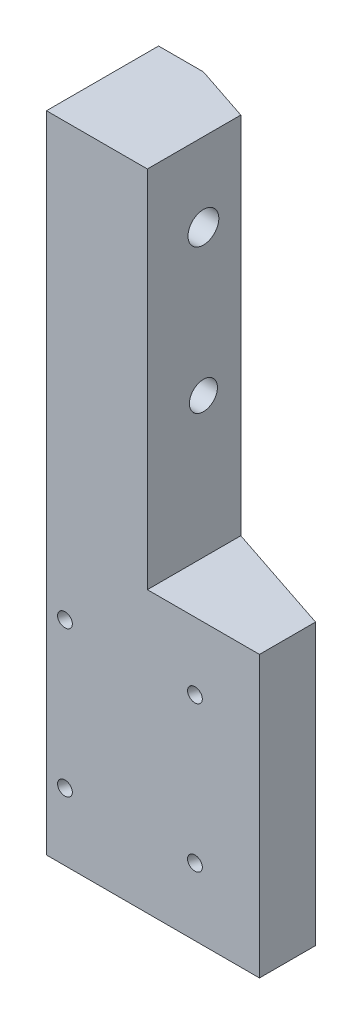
ISO-10303-21;
HEADER;
FILE_DESCRIPTION(('STEP AP214'),'2;1');
FILE_NAME('part.step','',(''),(''),'','','');
FILE_SCHEMA(('AUTOMOTIVE_DESIGN { 1 0 10303 214 1 1 1 1 }'));
ENDSEC;
DATA;
#1=APPLICATION_CONTEXT('core data for automotive mechanical design processes');
#2=APPLICATION_PROTOCOL_DEFINITION('international standard','automotive_design',2000,#1);
#3=PRODUCT_CONTEXT('',#1,'mechanical');
#4=PRODUCT('Part','Part','',(#3));
#5=PRODUCT_RELATED_PRODUCT_CATEGORY('part','',(#4));
#6=PRODUCT_DEFINITION_FORMATION('','',#4);
#7=PRODUCT_DEFINITION_CONTEXT('part definition',#1,'design');
#8=PRODUCT_DEFINITION('design','',#6,#7);
#9=PRODUCT_DEFINITION_SHAPE('','',#8);
#10=(LENGTH_UNIT() NAMED_UNIT(*) SI_UNIT(.MILLI.,.METRE.));
#11=(NAMED_UNIT(*) PLANE_ANGLE_UNIT() SI_UNIT($,.RADIAN.));
#12=(NAMED_UNIT(*) SI_UNIT($,.STERADIAN.) SOLID_ANGLE_UNIT());
#13=UNCERTAINTY_MEASURE_WITH_UNIT(LENGTH_MEASURE(1.E-05),#10,'distance_accuracy_value','');
#14=(GEOMETRIC_REPRESENTATION_CONTEXT(3) GLOBAL_UNCERTAINTY_ASSIGNED_CONTEXT((#13)) GLOBAL_UNIT_ASSIGNED_CONTEXT((#10,
#11,#12)) REPRESENTATION_CONTEXT('',''));
#15=CARTESIAN_POINT('',(0.,0.,0.));
#16=DIRECTION('',(0.,0.,1.));
#17=DIRECTION('',(1.,0.,0.));
#18=AXIS2_PLACEMENT_3D('',#15,#16,#17);
#19=CARTESIAN_POINT('',(-653.352980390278,-35.219950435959,20.));
#20=DIRECTION('',(1.,0.,0.));
#21=DIRECTION('',(0.,0.,-1.));
#22=AXIS2_PLACEMENT_3D('',#19,#20,#21);
#23=PLANE('',#22);
#24=CARTESIAN_POINT('',(-653.352980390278,65.780049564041,10.));
#25=DIRECTION('',(-1.,0.,0.));
#26=DIRECTION('',(0.,0.,1.));
#27=AXIS2_PLACEMENT_3D('',#24,#25,#26);
#28=CIRCLE('',#27,5.);
#29=CARTESIAN_POINT('',(-653.352980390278,65.780049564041,15.));
#30=VERTEX_POINT('',#29);
#31=EDGE_CURVE('E156',#30,#30,#28,.T.);
#32=ORIENTED_EDGE('',*,*,#31,.F.);
#33=EDGE_LOOP('',(#32));
#34=FACE_BOUND('',#33,.T.);
#35=CARTESIAN_POINT('',(-653.352980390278,39.7800495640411,10.));
#36=DIRECTION('',(-1.,0.,0.));
#37=DIRECTION('',(0.,0.,1.));
#38=AXIS2_PLACEMENT_3D('',#35,#36,#37);
#39=CIRCLE('',#38,2.5);
#40=CARTESIAN_POINT('',(-653.352980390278,39.7800495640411,12.5));
#41=VERTEX_POINT('',#40);
#42=EDGE_CURVE('E170',#41,#41,#39,.T.);
#43=ORIENTED_EDGE('',*,*,#42,.F.);
#44=EDGE_LOOP('',(#43));
#45=FACE_BOUND('',#44,.T.);
#46=DIRECTION('',(0.,-1.,0.));
#47=VECTOR('',#46,1.);
#48=CARTESIAN_POINT('',(-653.352980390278,-35.219950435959,0.));
#49=LINE('',#48,#47);
#50=CARTESIAN_POINT('',(-653.352980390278,79.780049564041,0.));
#51=VERTEX_POINT('',#50);
#52=CARTESIAN_POINT('',(-653.352980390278,-35.219950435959,0.));
#53=VERTEX_POINT('',#52);
#54=EDGE_CURVE('E109',#51,#53,#49,.T.);
#55=ORIENTED_EDGE('',*,*,#54,.T.);
#56=DIRECTION('',(0.,0.,-1.));
#57=VECTOR('',#56,1.);
#58=CARTESIAN_POINT('',(-653.352980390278,-35.219950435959,20.));
#59=LINE('',#58,#57);
#60=CARTESIAN_POINT('',(-653.352980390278,-35.219950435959,20.));
#61=VERTEX_POINT('',#60);
#62=EDGE_CURVE('E103',#61,#53,#59,.T.);
#63=ORIENTED_EDGE('',*,*,#62,.F.);
#64=DIRECTION('',(0.,-1.,0.));
#65=VECTOR('',#64,1.);
#66=CARTESIAN_POINT('',(-653.352980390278,-35.219950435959,20.));
#67=LINE('',#66,#65);
#68=CARTESIAN_POINT('',(-653.352980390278,79.780049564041,20.));
#69=VERTEX_POINT('',#68);
#70=EDGE_CURVE('E99',#69,#61,#67,.T.);
#71=ORIENTED_EDGE('',*,*,#70,.F.);
#72=DIRECTION('',(0.,0.,-1.));
#73=VECTOR('',#72,1.);
#74=CARTESIAN_POINT('',(-653.352980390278,79.780049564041,20.));
#75=LINE('',#74,#73);
#76=EDGE_CURVE('E97',#69,#51,#75,.T.);
#77=ORIENTED_EDGE('',*,*,#76,.T.);
#78=EDGE_LOOP('',(#55,#63,#71,#77));
#79=FACE_BOUND('',#78,.T.);
#80=ADVANCED_FACE('F16',(#34,#45,#79),#23,.F.);
#81=CARTESIAN_POINT('',(-653.352980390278,-35.219950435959,20.));
#82=DIRECTION('',(0.,1.,0.));
#83=DIRECTION('',(0.,0.,1.));
#84=AXIS2_PLACEMENT_3D('',#81,#82,#83);
#85=PLANE('',#84);
#86=DIRECTION('',(1.,0.,0.));
#87=VECTOR('',#86,1.);
#88=CARTESIAN_POINT('',(-653.352980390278,-35.219950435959,0.));
#89=LINE('',#88,#87);
#90=CARTESIAN_POINT('',(-645.352980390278,-35.219950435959,0.));
#91=VERTEX_POINT('',#90);
#92=EDGE_CURVE('E112',#53,#91,#89,.T.);
#93=ORIENTED_EDGE('',*,*,#92,.T.);
#94=DIRECTION('',(-0.948683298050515,0.,-0.316227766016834));
#95=VECTOR('',#94,1.);
#96=CARTESIAN_POINT('',(-645.352980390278,-35.219950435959,0.));
#97=LINE('',#96,#95);
#98=CARTESIAN_POINT('',(-615.352980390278,-35.219950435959,10.));
#99=VERTEX_POINT('',#98);
#100=EDGE_CURVE('E126',#91,#99,#97,.F.);
#101=ORIENTED_EDGE('',*,*,#100,.T.);
#102=DIRECTION('',(0.,0.,-1.));
#103=VECTOR('',#102,1.);
#104=CARTESIAN_POINT('',(-615.352980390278,-35.219950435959,20.));
#105=LINE('',#104,#103);
#106=CARTESIAN_POINT('',(-615.352980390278,-35.219950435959,20.));
#107=VERTEX_POINT('',#106);
#108=EDGE_CURVE('E153',#107,#99,#105,.T.);
#109=ORIENTED_EDGE('',*,*,#108,.F.);
#110=DIRECTION('',(1.,0.,0.));
#111=VECTOR('',#110,1.);
#112=CARTESIAN_POINT('',(-653.352980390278,-35.219950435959,20.));
#113=LINE('',#112,#111);
#114=EDGE_CURVE('E95',#61,#107,#113,.T.);
#115=ORIENTED_EDGE('',*,*,#114,.F.);
#116=ORIENTED_EDGE('',*,*,#62,.T.);
#117=EDGE_LOOP('',(#93,#101,#109,#115,#116));
#118=FACE_BOUND('',#117,.T.);
#119=ADVANCED_FACE('F180',(#118),#85,.F.);
#120=CARTESIAN_POINT('',(-635.352980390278,-35.219950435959,20.));
#121=DIRECTION('',(-1.,0.,0.));
#122=DIRECTION('',(0.,0.,1.));
#123=AXIS2_PLACEMENT_3D('',#120,#121,#122);
#124=PLANE('',#123);
#125=CARTESIAN_POINT('',(-635.352980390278,65.780049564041,10.));
#126=DIRECTION('',(-1.,0.,0.));
#127=DIRECTION('',(0.,0.,1.));
#128=AXIS2_PLACEMENT_3D('',#125,#126,#127);
#129=CIRCLE('',#128,2.75);
#130=CARTESIAN_POINT('',(-635.352980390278,65.780049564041,12.75));
#131=VERTEX_POINT('',#130);
#132=EDGE_CURVE('E167',#131,#131,#129,.T.);
#133=ORIENTED_EDGE('',*,*,#132,.T.);
#134=EDGE_LOOP('',(#133));
#135=FACE_BOUND('',#134,.T.);
#136=CARTESIAN_POINT('',(-635.352980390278,39.7800495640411,10.));
#137=DIRECTION('',(-1.,0.,0.));
#138=DIRECTION('',(0.,0.,1.));
#139=AXIS2_PLACEMENT_3D('',#136,#137,#138);
#140=CIRCLE('',#139,2.5);
#141=CARTESIAN_POINT('',(-635.352980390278,39.7800495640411,12.5));
#142=VERTEX_POINT('',#141);
#143=EDGE_CURVE('E113',#142,#142,#140,.T.);
#144=ORIENTED_EDGE('',*,*,#143,.T.);
#145=EDGE_LOOP('',(#144));
#146=FACE_BOUND('',#145,.T.);
#147=DIRECTION('',(0.,0.,-1.));
#148=VECTOR('',#147,1.);
#149=CARTESIAN_POINT('',(-635.352980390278,14.780049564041,20.));
#150=LINE('',#149,#148);
#151=CARTESIAN_POINT('',(-635.352980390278,14.780049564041,20.));
#152=VERTEX_POINT('',#151);
#153=CARTESIAN_POINT('',(-635.352980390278,14.780049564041,3.3333333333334));
#154=VERTEX_POINT('',#153);
#155=EDGE_CURVE('E75',#152,#154,#150,.T.);
#156=ORIENTED_EDGE('',*,*,#155,.T.);
#157=DIRECTION('',(0.,-1.,0.));
#158=VECTOR('',#157,1.);
#159=CARTESIAN_POINT('',(-635.352980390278,0.,3.3333333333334));
#160=LINE('',#159,#158);
#161=CARTESIAN_POINT('',(-635.352980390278,79.780049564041,3.3333333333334));
#162=VERTEX_POINT('',#161);
#163=EDGE_CURVE('E25',#154,#162,#160,.F.);
#164=ORIENTED_EDGE('',*,*,#163,.T.);
#165=DIRECTION('',(0.,0.,-1.));
#166=VECTOR('',#165,1.);
#167=CARTESIAN_POINT('',(-635.352980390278,79.780049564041,20.));
#168=LINE('',#167,#166);
#169=CARTESIAN_POINT('',(-635.352980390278,79.780049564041,20.));
#170=VERTEX_POINT('',#169);
#171=EDGE_CURVE('E92',#170,#162,#168,.T.);
#172=ORIENTED_EDGE('',*,*,#171,.F.);
#173=DIRECTION('',(0.,1.,0.));
#174=VECTOR('',#173,1.);
#175=CARTESIAN_POINT('',(-635.352980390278,-35.219950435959,20.));
#176=LINE('',#175,#174);
#177=EDGE_CURVE('E87',#152,#170,#176,.T.);
#178=ORIENTED_EDGE('',*,*,#177,.F.);
#179=EDGE_LOOP('',(#156,#164,#172,#178));
#180=FACE_BOUND('',#179,.T.);
#181=ADVANCED_FACE('F91',(#135,#146,#180),#124,.F.);
#182=CARTESIAN_POINT('',(-653.352980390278,79.780049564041,20.));
#183=DIRECTION('',(0.,-1.,0.));
#184=DIRECTION('',(0.,0.,-1.));
#185=AXIS2_PLACEMENT_3D('',#182,#183,#184);
#186=PLANE('',#185);
#187=ORIENTED_EDGE('',*,*,#171,.T.);
#188=DIRECTION('',(0.948683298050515,0.,0.316227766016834));
#189=VECTOR('',#188,1.);
#190=CARTESIAN_POINT('',(-645.352980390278,79.780049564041,0.));
#191=LINE('',#190,#189);
#192=CARTESIAN_POINT('',(-645.352980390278,79.780049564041,0.));
#193=VERTEX_POINT('',#192);
#194=EDGE_CURVE('E11',#162,#193,#191,.F.);
#195=ORIENTED_EDGE('',*,*,#194,.T.);
#196=DIRECTION('',(-1.,0.,0.));
#197=VECTOR('',#196,1.);
#198=CARTESIAN_POINT('',(-653.352980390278,79.780049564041,0.));
#199=LINE('',#198,#197);
#200=EDGE_CURVE('E116',#193,#51,#199,.T.);
#201=ORIENTED_EDGE('',*,*,#200,.T.);
#202=ORIENTED_EDGE('',*,*,#76,.F.);
#203=DIRECTION('',(-1.,0.,0.));
#204=VECTOR('',#203,1.);
#205=CARTESIAN_POINT('',(-653.352980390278,79.780049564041,20.));
#206=LINE('',#205,#204);
#207=EDGE_CURVE('E94',#170,#69,#206,.T.);
#208=ORIENTED_EDGE('',*,*,#207,.F.);
#209=EDGE_LOOP('',(#187,#195,#201,#202,#208));
#210=FACE_BOUND('',#209,.T.);
#211=ADVANCED_FACE('F185',(#210),#186,.F.);
#212=CARTESIAN_POINT('',(0.,0.,20.));
#213=DIRECTION('',(0.,0.,-1.));
#214=DIRECTION('',(-1.,0.,0.));
#215=AXIS2_PLACEMENT_3D('',#212,#213,#214);
#216=PLANE('',#215);
#217=CARTESIAN_POINT('',(-650.056260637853,2.78004956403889,20.));
#218=DIRECTION('',(0.,0.,-1.));
#219=DIRECTION('',(1.,0.,0.));
#220=AXIS2_PLACEMENT_3D('',#217,#218,#219);
#221=ELLIPSE('',#220,1.31761569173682,1.25);
#222=CARTESIAN_POINT('',(-648.738644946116,2.78004956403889,20.));
#223=VERTEX_POINT('',#222);
#224=EDGE_CURVE('E20',#223,#223,#221,.T.);
#225=ORIENTED_EDGE('',*,*,#224,.T.);
#226=EDGE_LOOP('',(#225));
#227=FACE_BOUND('',#226,.T.);
#228=CARTESIAN_POINT('',(-650.056260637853,-23.2199504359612,20.));
#229=DIRECTION('',(0.,0.,-1.));
#230=DIRECTION('',(1.,0.,0.));
#231=AXIS2_PLACEMENT_3D('',#228,#229,#230);
#232=ELLIPSE('',#231,1.31761569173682,1.25);
#233=CARTESIAN_POINT('',(-648.738644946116,-23.2199504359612,20.));
#234=VERTEX_POINT('',#233);
#235=EDGE_CURVE('E261',#234,#234,#232,.T.);
#236=ORIENTED_EDGE('',*,*,#235,.T.);
#237=EDGE_LOOP('',(#236));
#238=FACE_BOUND('',#237,.T.);
#239=CARTESIAN_POINT('',(-626.866224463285,-23.2199504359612,20.));
#240=DIRECTION('',(0.,0.,-1.));
#241=DIRECTION('',(1.,0.,0.));
#242=AXIS2_PLACEMENT_3D('',#239,#240,#241);
#243=ELLIPSE('',#242,1.31761569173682,1.25);
#244=CARTESIAN_POINT('',(-625.548608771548,-23.2199504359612,20.));
#245=VERTEX_POINT('',#244);
#246=EDGE_CURVE('E143',#245,#245,#243,.T.);
#247=ORIENTED_EDGE('',*,*,#246,.T.);
#248=EDGE_LOOP('',(#247));
#249=FACE_BOUND('',#248,.T.);
#250=CARTESIAN_POINT('',(-626.866224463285,2.78004956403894,20.));
#251=DIRECTION('',(0.,0.,-1.));
#252=DIRECTION('',(1.,0.,0.));
#253=AXIS2_PLACEMENT_3D('',#250,#251,#252);
#254=ELLIPSE('',#253,1.31761569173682,1.25);
#255=CARTESIAN_POINT('',(-625.548608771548,2.78004956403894,20.));
#256=VERTEX_POINT('',#255);
#257=EDGE_CURVE('E89',#256,#256,#254,.T.);
#258=ORIENTED_EDGE('',*,*,#257,.T.);
#259=EDGE_LOOP('',(#258));
#260=FACE_BOUND('',#259,.T.);
#261=ORIENTED_EDGE('',*,*,#70,.T.);
#262=ORIENTED_EDGE('',*,*,#114,.T.);
#263=DIRECTION('',(0.,-1.,0.));
#264=VECTOR('',#263,1.);
#265=CARTESIAN_POINT('',(-615.352980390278,-35.219950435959,20.));
#266=LINE('',#265,#264);
#267=CARTESIAN_POINT('',(-615.352980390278,14.780049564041,20.));
#268=VERTEX_POINT('',#267);
#269=EDGE_CURVE('E81',#268,#107,#266,.T.);
#270=ORIENTED_EDGE('',*,*,#269,.F.);
#271=DIRECTION('',(1.,0.,0.));
#272=VECTOR('',#271,1.);
#273=CARTESIAN_POINT('',(-635.352980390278,14.780049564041,20.));
#274=LINE('',#273,#272);
#275=EDGE_CURVE('E78',#152,#268,#274,.T.);
#276=ORIENTED_EDGE('',*,*,#275,.F.);
#277=ORIENTED_EDGE('',*,*,#177,.T.);
#278=ORIENTED_EDGE('',*,*,#207,.T.);
#279=EDGE_LOOP('',(#261,#262,#270,#276,#277,#278));
#280=FACE_BOUND('',#279,.T.);
#281=ADVANCED_FACE('F86',(#227,#238,#249,#260,#280),#216,.F.);
#282=CARTESIAN_POINT('',(0.,0.,0.));
#283=DIRECTION('',(0.,0.,-1.));
#284=DIRECTION('',(-1.,0.,0.));
#285=AXIS2_PLACEMENT_3D('',#282,#283,#284);
#286=PLANE('',#285);
#287=ORIENTED_EDGE('',*,*,#200,.F.);
#288=DIRECTION('',(0.,-1.,0.));
#289=VECTOR('',#288,1.);
#290=CARTESIAN_POINT('',(-645.352980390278,0.,0.));
#291=LINE('',#290,#289);
#292=EDGE_CURVE('E122',#193,#91,#291,.T.);
#293=ORIENTED_EDGE('',*,*,#292,.T.);
#294=ORIENTED_EDGE('',*,*,#92,.F.);
#295=ORIENTED_EDGE('',*,*,#54,.F.);
#296=EDGE_LOOP('',(#287,#293,#294,#295));
#297=FACE_BOUND('',#296,.T.);
#298=ADVANCED_FACE('F179',(#297),#286,.T.);
#299=CARTESIAN_POINT('',(-653.352980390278,39.7800495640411,10.));
#300=DIRECTION('',(-1.,0.,0.));
#301=DIRECTION('',(0.,0.,1.));
#302=AXIS2_PLACEMENT_3D('',#299,#300,#301);
#303=CYLINDRICAL_SURFACE('',#302,2.5);
#304=ORIENTED_EDGE('',*,*,#143,.F.);
#305=EDGE_LOOP('',(#304));
#306=FACE_BOUND('',#305,.T.);
#307=ORIENTED_EDGE('',*,*,#42,.T.);
#308=EDGE_LOOP('',(#307));
#309=FACE_BOUND('',#308,.T.);
#310=ADVANCED_FACE('F210',(#306,#309),#303,.F.);
#311=CARTESIAN_POINT('',(-653.352980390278,65.780049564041,10.));
#312=DIRECTION('',(-1.,0.,0.));
#313=DIRECTION('',(0.,0.,1.));
#314=AXIS2_PLACEMENT_3D('',#311,#312,#313);
#315=CYLINDRICAL_SURFACE('',#314,2.75);
#316=ORIENTED_EDGE('',*,*,#132,.F.);
#317=EDGE_LOOP('',(#316));
#318=FACE_BOUND('',#317,.T.);
#319=CARTESIAN_POINT('',(-647.652980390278,65.780049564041,10.));
#320=DIRECTION('',(-1.,0.,0.));
#321=DIRECTION('',(0.,0.,1.));
#322=AXIS2_PLACEMENT_3D('',#319,#320,#321);
#323=CIRCLE('',#322,2.75);
#324=CARTESIAN_POINT('',(-647.652980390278,65.780049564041,12.75));
#325=VERTEX_POINT('',#324);
#326=EDGE_CURVE('E164',#325,#325,#323,.T.);
#327=ORIENTED_EDGE('',*,*,#326,.T.);
#328=EDGE_LOOP('',(#327));
#329=FACE_BOUND('',#328,.T.);
#330=ADVANCED_FACE('F212',(#318,#329),#315,.F.);
#331=CARTESIAN_POINT('',(-647.652980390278,68.530049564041,10.));
#332=DIRECTION('',(1.,0.,0.));
#333=DIRECTION('',(0.,0.,-1.));
#334=AXIS2_PLACEMENT_3D('',#331,#332,#333);
#335=PLANE('',#334);
#336=ORIENTED_EDGE('',*,*,#326,.F.);
#337=EDGE_LOOP('',(#336));
#338=FACE_BOUND('',#337,.T.);
#339=CARTESIAN_POINT('',(-647.652980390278,65.780049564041,10.));
#340=DIRECTION('',(-1.,0.,0.));
#341=DIRECTION('',(0.,0.,1.));
#342=AXIS2_PLACEMENT_3D('',#339,#340,#341);
#343=CIRCLE('',#342,5.);
#344=CARTESIAN_POINT('',(-647.652980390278,65.780049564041,15.));
#345=VERTEX_POINT('',#344);
#346=EDGE_CURVE('E161',#345,#345,#343,.T.);
#347=ORIENTED_EDGE('',*,*,#346,.T.);
#348=EDGE_LOOP('',(#347));
#349=FACE_BOUND('',#348,.T.);
#350=ADVANCED_FACE('F220',(#338,#349),#335,.F.);
#351=CARTESIAN_POINT('',(-653.352980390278,65.780049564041,10.));
#352=DIRECTION('',(-1.,0.,0.));
#353=DIRECTION('',(0.,0.,1.));
#354=AXIS2_PLACEMENT_3D('',#351,#352,#353);
#355=CYLINDRICAL_SURFACE('',#354,5.);
#356=ORIENTED_EDGE('',*,*,#346,.F.);
#357=EDGE_LOOP('',(#356));
#358=FACE_BOUND('',#357,.T.);
#359=ORIENTED_EDGE('',*,*,#31,.T.);
#360=EDGE_LOOP('',(#359));
#361=FACE_BOUND('',#360,.T.);
#362=ADVANCED_FACE('F227',(#358,#361),#355,.F.);
#363=CARTESIAN_POINT('',(-615.352980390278,-35.219950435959,20.));
#364=DIRECTION('',(1.,0.,0.));
#365=DIRECTION('',(0.,0.,-1.));
#366=AXIS2_PLACEMENT_3D('',#363,#364,#365);
#367=PLANE('',#366);
#368=ORIENTED_EDGE('',*,*,#108,.T.);
#369=DIRECTION('',(0.,1.,0.));
#370=VECTOR('',#369,1.);
#371=CARTESIAN_POINT('',(-615.352980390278,-35.219950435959,10.));
#372=LINE('',#371,#370);
#373=CARTESIAN_POINT('',(-615.352980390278,14.780049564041,10.));
#374=VERTEX_POINT('',#373);
#375=EDGE_CURVE('E131',#99,#374,#372,.T.);
#376=ORIENTED_EDGE('',*,*,#375,.T.);
#377=DIRECTION('',(0.,0.,-1.));
#378=VECTOR('',#377,1.);
#379=CARTESIAN_POINT('',(-615.352980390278,14.780049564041,20.));
#380=LINE('',#379,#378);
#381=EDGE_CURVE('E80',#268,#374,#380,.T.);
#382=ORIENTED_EDGE('',*,*,#381,.F.);
#383=ORIENTED_EDGE('',*,*,#269,.T.);
#384=EDGE_LOOP('',(#368,#376,#382,#383));
#385=FACE_BOUND('',#384,.T.);
#386=ADVANCED_FACE('F184',(#385),#367,.T.);
#387=CARTESIAN_POINT('',(-635.352980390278,14.780049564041,20.));
#388=DIRECTION('',(0.,1.,0.));
#389=DIRECTION('',(-1.,0.,0.));
#390=AXIS2_PLACEMENT_3D('',#387,#388,#389);
#391=PLANE('',#390);
#392=ORIENTED_EDGE('',*,*,#381,.T.);
#393=DIRECTION('',(0.948683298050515,0.,0.316227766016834));
#394=VECTOR('',#393,1.);
#395=CARTESIAN_POINT('',(-630.352980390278,14.780049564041,5.));
#396=LINE('',#395,#394);
#397=EDGE_CURVE('E40',#374,#154,#396,.F.);
#398=ORIENTED_EDGE('',*,*,#397,.T.);
#399=ORIENTED_EDGE('',*,*,#155,.F.);
#400=ORIENTED_EDGE('',*,*,#275,.T.);
#401=EDGE_LOOP('',(#392,#398,#399,#400));
#402=FACE_BOUND('',#401,.T.);
#403=ADVANCED_FACE('F77',(#402),#391,.T.);
#404=CARTESIAN_POINT('',(-645.352980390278,0.,0.));
#405=DIRECTION('',(-0.316227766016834,0.,0.948683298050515));
#406=DIRECTION('',(0.,-1.,0.));
#407=AXIS2_PLACEMENT_3D('',#404,#405,#406);
#408=PLANE('',#407);
#409=CARTESIAN_POINT('',(-643.585932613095,2.78004956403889,0.589015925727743));
#410=DIRECTION('',(0.316227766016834,0.,-0.948683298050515));
#411=DIRECTION('',(-0.948683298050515,0.,-0.316227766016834));
#412=AXIS2_PLACEMENT_3D('',#409,#410,#411);
#413=CIRCLE('',#412,1.25);
#414=CARTESIAN_POINT('',(-644.771786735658,2.78004956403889,0.1937312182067));
#415=VERTEX_POINT('',#414);
#416=EDGE_CURVE('E256',#415,#415,#413,.T.);
#417=ORIENTED_EDGE('',*,*,#416,.F.);
#418=EDGE_LOOP('',(#417));
#419=FACE_BOUND('',#418,.T.);
#420=CARTESIAN_POINT('',(-643.585932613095,-23.2199504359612,0.589015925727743));
#421=DIRECTION('',(0.316227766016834,0.,-0.948683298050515));
#422=DIRECTION('',(-0.948683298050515,0.,-0.316227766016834));
#423=AXIS2_PLACEMENT_3D('',#420,#421,#422);
#424=CIRCLE('',#423,1.25);
#425=CARTESIAN_POINT('',(-644.771786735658,-23.2199504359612,0.1937312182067));
#426=VERTEX_POINT('',#425);
#427=EDGE_CURVE('E259',#426,#426,#424,.T.);
#428=ORIENTED_EDGE('',*,*,#427,.F.);
#429=EDGE_LOOP('',(#428));
#430=FACE_BOUND('',#429,.T.);
#431=CARTESIAN_POINT('',(-622.714900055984,-23.2199504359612,7.5460267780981));
#432=DIRECTION('',(0.316227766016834,0.,-0.948683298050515));
#433=DIRECTION('',(-0.948683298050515,0.,-0.316227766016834));
#434=AXIS2_PLACEMENT_3D('',#431,#432,#433);
#435=CIRCLE('',#434,1.25);
#436=CARTESIAN_POINT('',(-623.900754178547,-23.2199504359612,7.15074207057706));
#437=VERTEX_POINT('',#436);
#438=EDGE_CURVE('E148',#437,#437,#435,.T.);
#439=ORIENTED_EDGE('',*,*,#438,.F.);
#440=EDGE_LOOP('',(#439));
#441=FACE_BOUND('',#440,.T.);
#442=CARTESIAN_POINT('',(-622.714900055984,2.78004956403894,7.5460267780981));
#443=DIRECTION('',(0.316227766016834,0.,-0.948683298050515));
#444=DIRECTION('',(-0.948683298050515,0.,-0.316227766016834));
#445=AXIS2_PLACEMENT_3D('',#442,#443,#444);
#446=CIRCLE('',#445,1.25);
#447=CARTESIAN_POINT('',(-623.900754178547,2.78004956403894,7.15074207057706));
#448=VERTEX_POINT('',#447);
#449=EDGE_CURVE('E139',#448,#448,#446,.T.);
#450=ORIENTED_EDGE('',*,*,#449,.F.);
#451=EDGE_LOOP('',(#450));
#452=FACE_BOUND('',#451,.T.);
#453=ORIENTED_EDGE('',*,*,#397,.F.);
#454=ORIENTED_EDGE('',*,*,#375,.F.);
#455=ORIENTED_EDGE('',*,*,#100,.F.);
#456=ORIENTED_EDGE('',*,*,#292,.F.);
#457=ORIENTED_EDGE('',*,*,#194,.F.);
#458=ORIENTED_EDGE('',*,*,#163,.F.);
#459=EDGE_LOOP('',(#453,#454,#455,#456,#457,#458));
#460=FACE_BOUND('',#459,.T.);
#461=ADVANCED_FACE('F18',(#419,#430,#441,#452,#460),#408,.F.);
#462=CARTESIAN_POINT('',(-622.714900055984,2.78004956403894,7.5460267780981));
#463=DIRECTION('',(0.316227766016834,0.,-0.948683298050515));
#464=DIRECTION('',(-0.948683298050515,0.,-0.316227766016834));
#465=AXIS2_PLACEMENT_3D('',#462,#463,#464);
#466=CYLINDRICAL_SURFACE('',#465,1.25);
#467=ORIENTED_EDGE('',*,*,#449,.T.);
#468=EDGE_LOOP('',(#467));
#469=FACE_BOUND('',#468,.T.);
#470=ORIENTED_EDGE('',*,*,#257,.F.);
#471=EDGE_LOOP('',(#470));
#472=FACE_BOUND('',#471,.T.);
#473=ADVANCED_FACE('F236',(#469,#472),#466,.F.);
#474=CARTESIAN_POINT('',(-622.714900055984,-23.2199504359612,7.5460267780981));
#475=DIRECTION('',(0.316227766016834,0.,-0.948683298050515));
#476=DIRECTION('',(-0.948683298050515,0.,-0.316227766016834));
#477=AXIS2_PLACEMENT_3D('',#474,#475,#476);
#478=CYLINDRICAL_SURFACE('',#477,1.25);
#479=ORIENTED_EDGE('',*,*,#438,.T.);
#480=EDGE_LOOP('',(#479));
#481=FACE_BOUND('',#480,.T.);
#482=ORIENTED_EDGE('',*,*,#246,.F.);
#483=EDGE_LOOP('',(#482));
#484=FACE_BOUND('',#483,.T.);
#485=ADVANCED_FACE('F239',(#481,#484),#478,.F.);
#486=CARTESIAN_POINT('',(-643.585932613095,-23.2199504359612,0.589015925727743));
#487=DIRECTION('',(0.316227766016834,0.,-0.948683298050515));
#488=DIRECTION('',(-0.948683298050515,0.,-0.316227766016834));
#489=AXIS2_PLACEMENT_3D('',#486,#487,#488);
#490=CYLINDRICAL_SURFACE('',#489,1.25);
#491=ORIENTED_EDGE('',*,*,#427,.T.);
#492=EDGE_LOOP('',(#491));
#493=FACE_BOUND('',#492,.T.);
#494=ORIENTED_EDGE('',*,*,#235,.F.);
#495=EDGE_LOOP('',(#494));
#496=FACE_BOUND('',#495,.T.);
#497=ADVANCED_FACE('F242',(#493,#496),#490,.F.);
#498=CARTESIAN_POINT('',(-643.585932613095,2.78004956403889,0.589015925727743));
#499=DIRECTION('',(0.316227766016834,0.,-0.948683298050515));
#500=DIRECTION('',(-0.948683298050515,0.,-0.316227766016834));
#501=AXIS2_PLACEMENT_3D('',#498,#499,#500);
#502=CYLINDRICAL_SURFACE('',#501,1.25);
#503=ORIENTED_EDGE('',*,*,#416,.T.);
#504=EDGE_LOOP('',(#503));
#505=FACE_BOUND('',#504,.T.);
#506=ORIENTED_EDGE('',*,*,#224,.F.);
#507=EDGE_LOOP('',(#506));
#508=FACE_BOUND('',#507,.T.);
#509=ADVANCED_FACE('F246',(#505,#508),#502,.F.);
#510=CLOSED_SHELL('',(#80,#119,#181,#211,#281,#298,#310,#330,#350,#362,#386,#403,#461,#473,#485,
#497,#509));
#511=MANIFOLD_SOLID_BREP('B1',#510);
#512=ADVANCED_BREP_SHAPE_REPRESENTATION('',(#18,#511),#14);
#513=SHAPE_DEFINITION_REPRESENTATION(#9,#512);
ENDSEC;
END-ISO-10303-21;
